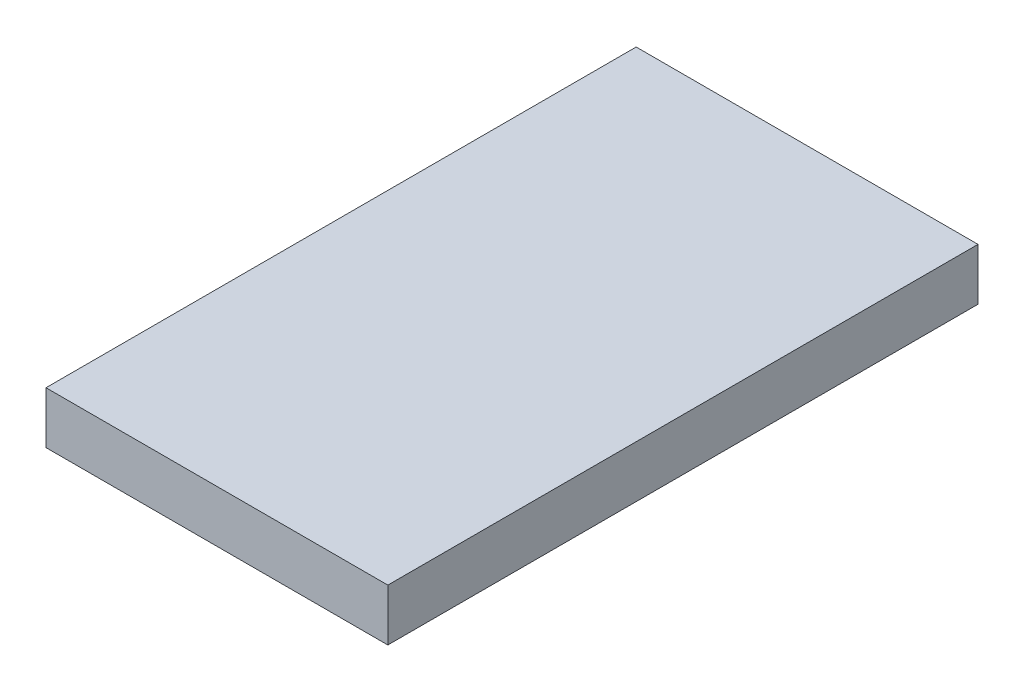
ISO-10303-21;
HEADER;
FILE_DESCRIPTION(('STEP AP214'),'2;1');
FILE_NAME('part.step','',(''),(''),'','','');
FILE_SCHEMA(('AUTOMOTIVE_DESIGN { 1 0 10303 214 1 1 1 1 }'));
ENDSEC;
DATA;
#1=APPLICATION_CONTEXT('core data for automotive mechanical design processes');
#2=APPLICATION_PROTOCOL_DEFINITION('international standard','automotive_design',2000,#1);
#3=PRODUCT_CONTEXT('',#1,'mechanical');
#4=PRODUCT('Part','Part','',(#3));
#5=PRODUCT_RELATED_PRODUCT_CATEGORY('part','',(#4));
#6=PRODUCT_DEFINITION_FORMATION('','',#4);
#7=PRODUCT_DEFINITION_CONTEXT('part definition',#1,'design');
#8=PRODUCT_DEFINITION('design','',#6,#7);
#9=PRODUCT_DEFINITION_SHAPE('','',#8);
#10=(LENGTH_UNIT() NAMED_UNIT(*) SI_UNIT(.MILLI.,.METRE.));
#11=(NAMED_UNIT(*) PLANE_ANGLE_UNIT() SI_UNIT($,.RADIAN.));
#12=(NAMED_UNIT(*) SI_UNIT($,.STERADIAN.) SOLID_ANGLE_UNIT());
#13=UNCERTAINTY_MEASURE_WITH_UNIT(LENGTH_MEASURE(1.E-05),#10,'distance_accuracy_value','');
#14=(GEOMETRIC_REPRESENTATION_CONTEXT(3) GLOBAL_UNCERTAINTY_ASSIGNED_CONTEXT((#13)) GLOBAL_UNIT_ASSIGNED_CONTEXT((#10,
#11,#12)) REPRESENTATION_CONTEXT('',''));
#15=CARTESIAN_POINT('',(0.,0.,0.));
#16=DIRECTION('',(0.,0.,1.));
#17=DIRECTION('',(1.,0.,0.));
#18=AXIS2_PLACEMENT_3D('',#15,#16,#17);
#19=CARTESIAN_POINT('',(0.,-50.8,149.2));
#20=DIRECTION('',(-1.,0.,0.));
#21=DIRECTION('',(0.,0.,1.));
#22=AXIS2_PLACEMENT_3D('',#19,#20,#21);
#23=PLANE('',#22);
#24=DIRECTION('',(0.,0.,1.));
#25=VECTOR('',#24,1.);
#26=CARTESIAN_POINT('',(0.,0.,149.2));
#27=LINE('',#26,#25);
#28=CARTESIAN_POINT('',(0.,0.,-428.6));
#29=VERTEX_POINT('',#28);
#30=CARTESIAN_POINT('',(0.,0.,149.2));
#31=VERTEX_POINT('',#30);
#32=EDGE_CURVE('E95',#29,#31,#27,.T.);
#33=ORIENTED_EDGE('',*,*,#32,.T.);
#34=DIRECTION('',(0.,1.,0.));
#35=VECTOR('',#34,1.);
#36=CARTESIAN_POINT('',(0.,-50.8,149.2));
#37=LINE('',#36,#35);
#38=CARTESIAN_POINT('',(0.,-50.8,149.2));
#39=VERTEX_POINT('',#38);
#40=EDGE_CURVE('E11',#39,#31,#37,.T.);
#41=ORIENTED_EDGE('',*,*,#40,.F.);
#42=DIRECTION('',(0.,0.,1.));
#43=VECTOR('',#42,1.);
#44=CARTESIAN_POINT('',(0.,-50.8,149.2));
#45=LINE('',#44,#43);
#46=CARTESIAN_POINT('',(0.,-50.8,-428.6));
#47=VERTEX_POINT('',#46);
#48=EDGE_CURVE('E83',#47,#39,#45,.T.);
#49=ORIENTED_EDGE('',*,*,#48,.F.);
#50=DIRECTION('',(0.,1.,0.));
#51=VECTOR('',#50,1.);
#52=CARTESIAN_POINT('',(0.,-50.8,-428.6));
#53=LINE('',#52,#51);
#54=EDGE_CURVE('E91',#47,#29,#53,.T.);
#55=ORIENTED_EDGE('',*,*,#54,.T.);
#56=EDGE_LOOP('',(#33,#41,#49,#55));
#57=FACE_BOUND('',#56,.T.);
#58=ADVANCED_FACE('F32',(#57),#23,.F.);
#59=CARTESIAN_POINT('',(0.,-50.8,149.2));
#60=DIRECTION('',(0.,0.,-1.));
#61=DIRECTION('',(-1.,0.,0.));
#62=AXIS2_PLACEMENT_3D('',#59,#60,#61);
#63=PLANE('',#62);
#64=DIRECTION('',(-1.,0.,0.));
#65=VECTOR('',#64,1.);
#66=CARTESIAN_POINT('',(0.,0.,149.2));
#67=LINE('',#66,#65);
#68=CARTESIAN_POINT('',(-334.676590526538,0.,149.2));
#69=VERTEX_POINT('',#68);
#70=EDGE_CURVE('E87',#31,#69,#67,.T.);
#71=ORIENTED_EDGE('',*,*,#70,.T.);
#72=DIRECTION('',(0.,1.,0.));
#73=VECTOR('',#72,1.);
#74=CARTESIAN_POINT('',(-334.676590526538,-50.8,149.2));
#75=LINE('',#74,#73);
#76=CARTESIAN_POINT('',(-334.676590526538,-50.8,149.2));
#77=VERTEX_POINT('',#76);
#78=EDGE_CURVE('E40',#77,#69,#75,.T.);
#79=ORIENTED_EDGE('',*,*,#78,.F.);
#80=DIRECTION('',(-1.,0.,0.));
#81=VECTOR('',#80,1.);
#82=CARTESIAN_POINT('',(0.,-50.8,149.2));
#83=LINE('',#82,#81);
#84=EDGE_CURVE('E78',#39,#77,#83,.T.);
#85=ORIENTED_EDGE('',*,*,#84,.F.);
#86=ORIENTED_EDGE('',*,*,#40,.T.);
#87=EDGE_LOOP('',(#71,#79,#85,#86));
#88=FACE_BOUND('',#87,.T.);
#89=ADVANCED_FACE('F86',(#88),#63,.F.);
#90=CARTESIAN_POINT('',(-334.676590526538,-50.8,149.2));
#91=DIRECTION('',(1.,0.,0.));
#92=DIRECTION('',(0.,0.,-1.));
#93=AXIS2_PLACEMENT_3D('',#90,#91,#92);
#94=PLANE('',#93);
#95=DIRECTION('',(0.,0.,-1.));
#96=VECTOR('',#95,1.);
#97=CARTESIAN_POINT('',(-334.676590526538,0.,149.2));
#98=LINE('',#97,#96);
#99=CARTESIAN_POINT('',(-334.676590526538,0.,-428.6));
#100=VERTEX_POINT('',#99);
#101=EDGE_CURVE('E65',#69,#100,#98,.T.);
#102=ORIENTED_EDGE('',*,*,#101,.T.);
#103=DIRECTION('',(0.,1.,0.));
#104=VECTOR('',#103,1.);
#105=CARTESIAN_POINT('',(-334.676590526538,-50.8,-428.6));
#106=LINE('',#105,#104);
#107=CARTESIAN_POINT('',(-334.676590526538,-50.8,-428.6));
#108=VERTEX_POINT('',#107);
#109=EDGE_CURVE('E88',#108,#100,#106,.T.);
#110=ORIENTED_EDGE('',*,*,#109,.F.);
#111=DIRECTION('',(0.,0.,-1.));
#112=VECTOR('',#111,1.);
#113=CARTESIAN_POINT('',(-334.676590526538,-50.8,149.2));
#114=LINE('',#113,#112);
#115=EDGE_CURVE('E81',#77,#108,#114,.T.);
#116=ORIENTED_EDGE('',*,*,#115,.F.);
#117=ORIENTED_EDGE('',*,*,#78,.T.);
#118=EDGE_LOOP('',(#102,#110,#116,#117));
#119=FACE_BOUND('',#118,.T.);
#120=ADVANCED_FACE('F89',(#119),#94,.F.);
#121=CARTESIAN_POINT('',(0.,-50.8,-428.6));
#122=DIRECTION('',(0.,0.,1.));
#123=DIRECTION('',(1.,0.,0.));
#124=AXIS2_PLACEMENT_3D('',#121,#122,#123);
#125=PLANE('',#124);
#126=DIRECTION('',(1.,0.,0.));
#127=VECTOR('',#126,1.);
#128=CARTESIAN_POINT('',(0.,0.,-428.6));
#129=LINE('',#128,#127);
#130=EDGE_CURVE('E71',#100,#29,#129,.T.);
#131=ORIENTED_EDGE('',*,*,#130,.T.);
#132=ORIENTED_EDGE('',*,*,#54,.F.);
#133=DIRECTION('',(1.,0.,0.));
#134=VECTOR('',#133,1.);
#135=CARTESIAN_POINT('',(0.,-50.8,-428.6));
#136=LINE('',#135,#134);
#137=EDGE_CURVE('E48',#108,#47,#136,.T.);
#138=ORIENTED_EDGE('',*,*,#137,.F.);
#139=ORIENTED_EDGE('',*,*,#109,.T.);
#140=EDGE_LOOP('',(#131,#132,#138,#139));
#141=FACE_BOUND('',#140,.T.);
#142=ADVANCED_FACE('F102',(#141),#125,.F.);
#143=CARTESIAN_POINT('',(0.,-50.8,-428.6));
#144=DIRECTION('',(0.,1.,0.));
#145=DIRECTION('',(0.,0.,1.));
#146=AXIS2_PLACEMENT_3D('',#143,#144,#145);
#147=PLANE('',#146);
#148=ORIENTED_EDGE('',*,*,#48,.T.);
#149=ORIENTED_EDGE('',*,*,#84,.T.);
#150=ORIENTED_EDGE('',*,*,#115,.T.);
#151=ORIENTED_EDGE('',*,*,#137,.T.);
#152=EDGE_LOOP('',(#148,#149,#150,#151));
#153=FACE_BOUND('',#152,.T.);
#154=ADVANCED_FACE('F79',(#153),#147,.F.);
#155=CARTESIAN_POINT('',(0.,0.,-428.6));
#156=DIRECTION('',(0.,1.,0.));
#157=DIRECTION('',(0.,0.,1.));
#158=AXIS2_PLACEMENT_3D('',#155,#156,#157);
#159=PLANE('',#158);
#160=ORIENTED_EDGE('',*,*,#32,.F.);
#161=ORIENTED_EDGE('',*,*,#130,.F.);
#162=ORIENTED_EDGE('',*,*,#101,.F.);
#163=ORIENTED_EDGE('',*,*,#70,.F.);
#164=EDGE_LOOP('',(#160,#161,#162,#163));
#165=FACE_BOUND('',#164,.T.);
#166=ADVANCED_FACE('F105',(#165),#159,.T.);
#167=CLOSED_SHELL('',(#58,#89,#120,#142,#154,#166));
#168=MANIFOLD_SOLID_BREP('B2',#167);
#169=ADVANCED_BREP_SHAPE_REPRESENTATION('',(#18,#168),#14);
#170=SHAPE_DEFINITION_REPRESENTATION(#9,#169);
ENDSEC;
END-ISO-10303-21;
